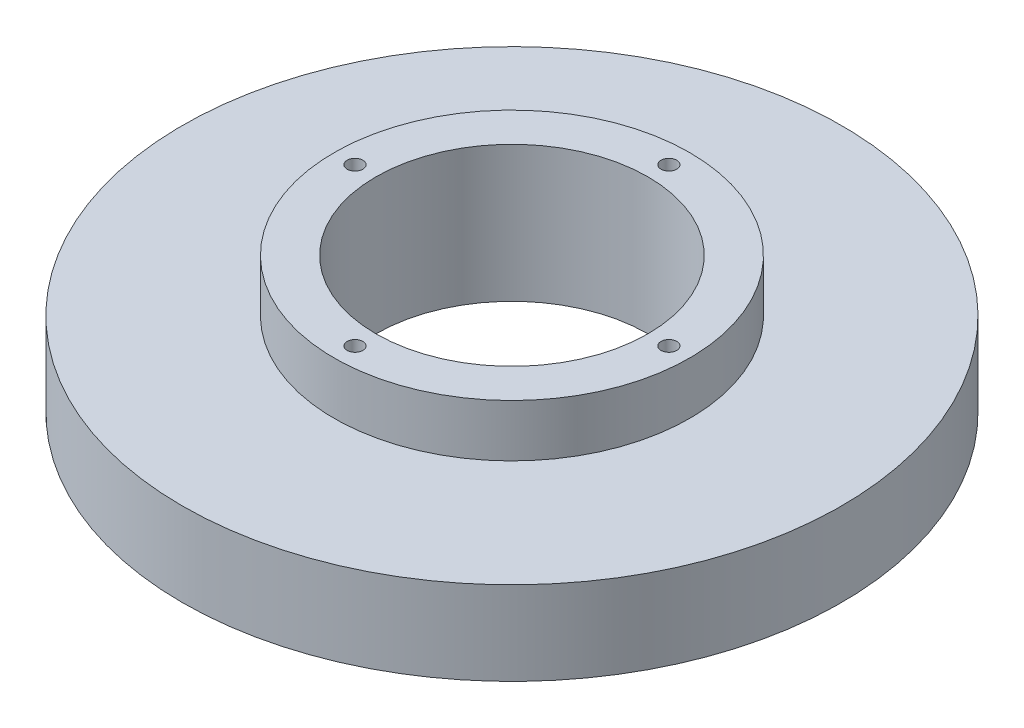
from build123d import *

# Parameters (mm, degrees)
SKETCH_1_R          = 63
SKETCH_1_R_2        = 34
EXTRUDE_1_DEPTH     = 16
SKETCH_1_3_R        = 34
SKETCH_1_3_R_2      = 26
EXTRUDE_2_DEPTH     = 26
SKETCH_2_R          = 1.5
CUT_EXTRUDE_1_DEPTH = 93.811637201


with BuildPart() as part:
    # Sketch 1 → Extrude 1 (new body)
    with BuildSketch(Plane(origin=(0, 0, 0), x_dir=(1, 0, 0), z_dir=(0, 1, 0))):
        with Locations(Location((0, 0, 0), (0, 0, 270))):
            Circle(SKETCH_1_R)
        with Locations(Location((0, 0, 0), (0, 0, 270))):
            Circle(SKETCH_1_R_2, mode=Mode.SUBTRACT)
    extrude(amount=EXTRUDE_1_DEPTH)

    # Sketch 1_3 → Extrude 2 (add)
    with BuildSketch(Plane(origin=(0, 0, 0), x_dir=(1, 0, 0), z_dir=(0, 1, 0))):
        with Locations(Location((0, 0, 0), (0, 0, 90))):
            Circle(SKETCH_1_3_R)
        with Locations(Location((0, 0, 0), (0, 0, 90))):
            Circle(SKETCH_1_3_R_2, mode=Mode.SUBTRACT)
    extrude(amount=EXTRUDE_2_DEPTH)

    # Sketch 2 → Cut-Extrude 1 (cut, through all)
    with BuildSketch(Plane(origin=(0, 26, 0), x_dir=(1, 0, 0), z_dir=(0, 1, 0))):
        with Locations(Location((30, 0, 0), (0, 0, 270))):
            Circle(SKETCH_2_R)
        with Locations(Location((0, -30, 0), (0, 0, 270))):
            Circle(SKETCH_2_R)
        with Locations(Location((-30, 0, 0), (0, 0, 270))):
            Circle(SKETCH_2_R)
        with Locations(Location((0, 30, 0), (0, 0, 270))):
            Circle(SKETCH_2_R)
    extrude(amount=-CUT_EXTRUDE_1_DEPTH, mode=Mode.SUBTRACT)


solid = part.part
